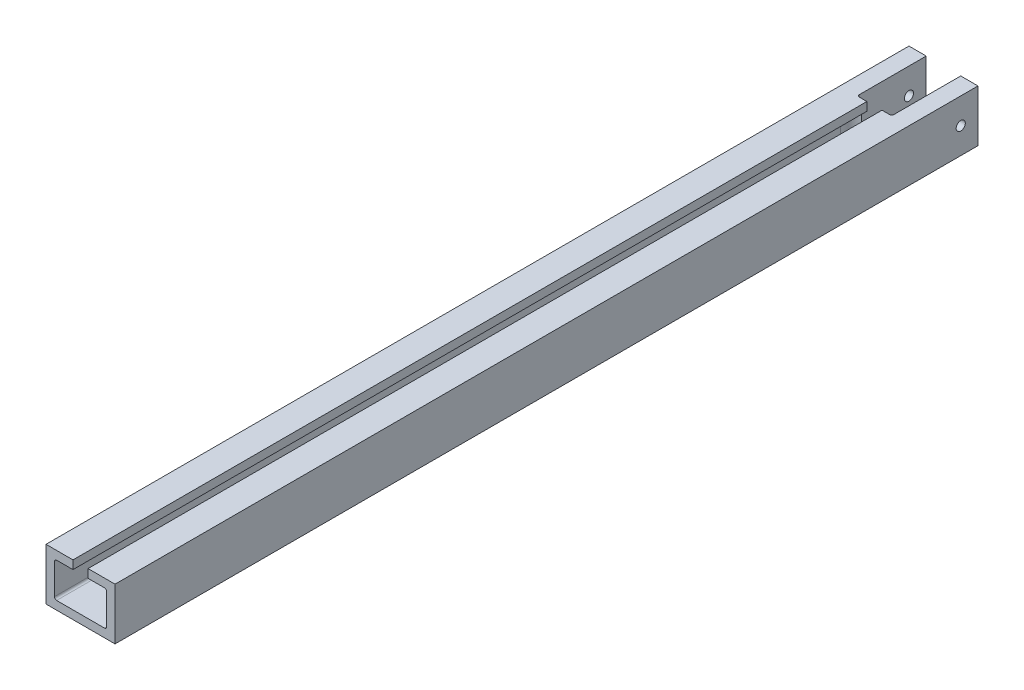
ISO-10303-21;
HEADER;
FILE_DESCRIPTION(('STEP AP214'),'2;1');
FILE_NAME('part.step','',(''),(''),'','','');
FILE_SCHEMA(('AUTOMOTIVE_DESIGN { 1 0 10303 214 1 1 1 1 }'));
ENDSEC;
DATA;
#1=APPLICATION_CONTEXT('core data for automotive mechanical design processes');
#2=APPLICATION_PROTOCOL_DEFINITION('international standard','automotive_design',2000,#1);
#3=PRODUCT_CONTEXT('',#1,'mechanical');
#4=PRODUCT('Part','Part','',(#3));
#5=PRODUCT_RELATED_PRODUCT_CATEGORY('part','',(#4));
#6=PRODUCT_DEFINITION_FORMATION('','',#4);
#7=PRODUCT_DEFINITION_CONTEXT('part definition',#1,'design');
#8=PRODUCT_DEFINITION('design','',#6,#7);
#9=PRODUCT_DEFINITION_SHAPE('','',#8);
#10=(LENGTH_UNIT() NAMED_UNIT(*) SI_UNIT(.MILLI.,.METRE.));
#11=(NAMED_UNIT(*) PLANE_ANGLE_UNIT() SI_UNIT($,.RADIAN.));
#12=(NAMED_UNIT(*) SI_UNIT($,.STERADIAN.) SOLID_ANGLE_UNIT());
#13=UNCERTAINTY_MEASURE_WITH_UNIT(LENGTH_MEASURE(1.E-05),#10,'distance_accuracy_value','');
#14=(GEOMETRIC_REPRESENTATION_CONTEXT(3) GLOBAL_UNCERTAINTY_ASSIGNED_CONTEXT((#13)) GLOBAL_UNIT_ASSIGNED_CONTEXT((#10,
#11,#12)) REPRESENTATION_CONTEXT('',''));
#15=CARTESIAN_POINT('',(0.,0.,0.));
#16=DIRECTION('',(0.,0.,1.));
#17=DIRECTION('',(1.,0.,0.));
#18=AXIS2_PLACEMENT_3D('',#15,#16,#17);
#19=CARTESIAN_POINT('',(0.,0.,76.2));
#20=DIRECTION('',(0.,0.,-1.));
#21=DIRECTION('',(-1.,0.,0.));
#22=AXIS2_PLACEMENT_3D('',#19,#20,#21);
#23=PLANE('',#22);
#24=DIRECTION('',(1.,0.,0.));
#25=VECTOR('',#24,1.);
#26=CARTESIAN_POINT('',(0.,25.654,76.2));
#27=LINE('',#26,#25);
#28=CARTESIAN_POINT('',(11.1125,25.654,76.2));
#29=VERTEX_POINT('',#28);
#30=CARTESIAN_POINT('',(22.225,25.654,76.2));
#31=VERTEX_POINT('',#30);
#32=EDGE_CURVE('E477',#29,#31,#27,.T.);
#33=ORIENTED_EDGE('',*,*,#32,.F.);
#34=DIRECTION('',(0.,-1.,0.));
#35=VECTOR('',#34,1.);
#36=CARTESIAN_POINT('',(11.1125,21.4188992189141,76.2));
#37=LINE('',#36,#35);
#38=CARTESIAN_POINT('',(11.1125,38.1,76.2));
#39=VERTEX_POINT('',#38);
#40=EDGE_CURVE('E496',#39,#29,#37,.T.);
#41=ORIENTED_EDGE('',*,*,#40,.F.);
#42=DIRECTION('',(1.,0.,0.));
#43=VECTOR('',#42,1.);
#44=CARTESIAN_POINT('',(25.4,38.1,76.2));
#45=LINE('',#44,#43);
#46=CARTESIAN_POINT('',(22.225,38.1,76.2));
#47=VERTEX_POINT('',#46);
#48=EDGE_CURVE('E512',#39,#47,#45,.T.);
#49=ORIENTED_EDGE('',*,*,#48,.T.);
#50=DIRECTION('',(0.,-1.,0.));
#51=VECTOR('',#50,1.);
#52=CARTESIAN_POINT('',(22.225,0.,76.2));
#53=LINE('',#52,#51);
#54=EDGE_CURVE('E574',#47,#31,#53,.T.);
#55=ORIENTED_EDGE('',*,*,#54,.T.);
#56=EDGE_LOOP('',(#33,#41,#49,#55));
#57=FACE_BOUND('',#56,.T.);
#58=ADVANCED_FACE('F45',(#57),#23,.T.);
#59=CARTESIAN_POINT('',(50.8,38.1,1244.6));
#60=DIRECTION('',(0.,-1.,0.));
#61=DIRECTION('',(0.,0.,-1.));
#62=AXIS2_PLACEMENT_3D('',#59,#60,#61);
#63=PLANE('',#62);
#64=ORIENTED_EDGE('',*,*,#48,.F.);
#65=DIRECTION('',(0.,0.,-1.));
#66=VECTOR('',#65,1.);
#67=CARTESIAN_POINT('',(11.1125,38.1,1244.6));
#68=LINE('',#67,#66);
#69=CARTESIAN_POINT('',(11.1125,38.1,1244.6));
#70=VERTEX_POINT('',#69);
#71=EDGE_CURVE('E503',#70,#39,#68,.T.);
#72=ORIENTED_EDGE('',*,*,#71,.F.);
#73=DIRECTION('',(-1.,0.,0.));
#74=VECTOR('',#73,1.);
#75=CARTESIAN_POINT('',(50.8,38.1,1244.6));
#76=LINE('',#75,#74);
#77=CARTESIAN_POINT('',(50.8,38.1,1244.6));
#78=VERTEX_POINT('',#77);
#79=EDGE_CURVE('E550',#78,#70,#76,.T.);
#80=ORIENTED_EDGE('',*,*,#79,.F.);
#81=DIRECTION('',(0.,0.,1.));
#82=VECTOR('',#81,1.);
#83=CARTESIAN_POINT('',(50.8,38.1,1244.6));
#84=LINE('',#83,#82);
#85=CARTESIAN_POINT('',(50.8,38.1,-25.4));
#86=VERTEX_POINT('',#85);
#87=EDGE_CURVE('E528',#86,#78,#84,.T.);
#88=ORIENTED_EDGE('',*,*,#87,.F.);
#89=DIRECTION('',(-1.,0.,0.));
#90=VECTOR('',#89,1.);
#91=CARTESIAN_POINT('',(50.8,38.1,-25.4));
#92=LINE('',#91,#90);
#93=CARTESIAN_POINT('',(25.4,38.1,-25.4));
#94=VERTEX_POINT('',#93);
#95=EDGE_CURVE('E554',#86,#94,#92,.T.);
#96=ORIENTED_EDGE('',*,*,#95,.T.);
#97=DIRECTION('',(0.,0.,-1.));
#98=VECTOR('',#97,1.);
#99=CARTESIAN_POINT('',(25.4,38.1,76.2));
#100=LINE('',#99,#98);
#101=CARTESIAN_POINT('',(25.4,38.1,73.025));
#102=VERTEX_POINT('',#101);
#103=EDGE_CURVE('E521',#102,#94,#100,.T.);
#104=ORIENTED_EDGE('',*,*,#103,.F.);
#105=CARTESIAN_POINT('',(22.225,38.1,73.025));
#106=DIRECTION('',(0.,-1.,0.));
#107=DIRECTION('',(0.,0.,-1.));
#108=AXIS2_PLACEMENT_3D('',#105,#106,#107);
#109=CIRCLE('',#108,3.175);
#110=EDGE_CURVE('E581',#102,#47,#109,.T.);
#111=ORIENTED_EDGE('',*,*,#110,.T.);
#112=EDGE_LOOP('',(#64,#72,#80,#88,#96,#104,#111));
#113=FACE_BOUND('',#112,.T.);
#114=ADVANCED_FACE('F404',(#113),#63,.F.);
#115=CARTESIAN_POINT('',(50.8,-38.1,-25.4));
#116=DIRECTION('',(0.,0.,1.));
#117=DIRECTION('',(1.,0.,0.));
#118=AXIS2_PLACEMENT_3D('',#115,#116,#117);
#119=PLANE('',#118);
#120=DIRECTION('',(-1.,0.,0.));
#121=VECTOR('',#120,1.);
#122=CARTESIAN_POINT('',(25.4,-28.575,-25.4));
#123=LINE('',#122,#121);
#124=CARTESIAN_POINT('',(22.225,-28.575,-25.4));
#125=VERTEX_POINT('',#124);
#126=CARTESIAN_POINT('',(-22.225,-28.575,-25.4));
#127=VERTEX_POINT('',#126);
#128=EDGE_CURVE('E515',#125,#127,#123,.T.);
#129=ORIENTED_EDGE('',*,*,#128,.F.);
#130=CARTESIAN_POINT('',(22.225,-25.4,-25.4));
#131=DIRECTION('',(0.,0.,1.));
#132=DIRECTION('',(1.,0.,0.));
#133=AXIS2_PLACEMENT_3D('',#130,#131,#132);
#134=CIRCLE('',#133,3.175);
#135=CARTESIAN_POINT('',(25.4,-25.4,-25.4));
#136=VERTEX_POINT('',#135);
#137=EDGE_CURVE('E579',#125,#136,#134,.T.);
#138=ORIENTED_EDGE('',*,*,#137,.T.);
#139=DIRECTION('',(0.,-1.,0.));
#140=VECTOR('',#139,1.);
#141=CARTESIAN_POINT('',(25.4,38.1,-25.4));
#142=LINE('',#141,#140);
#143=EDGE_CURVE('E505',#94,#136,#142,.T.);
#144=ORIENTED_EDGE('',*,*,#143,.F.);
#145=ORIENTED_EDGE('',*,*,#95,.F.);
#146=DIRECTION('',(0.,1.,0.));
#147=VECTOR('',#146,1.);
#148=CARTESIAN_POINT('',(50.8,-38.1,-25.4));
#149=LINE('',#148,#147);
#150=CARTESIAN_POINT('',(50.8,-38.1,-25.4));
#151=VERTEX_POINT('',#150);
#152=EDGE_CURVE('E525',#151,#86,#149,.T.);
#153=ORIENTED_EDGE('',*,*,#152,.F.);
#154=DIRECTION('',(-1.,0.,0.));
#155=VECTOR('',#154,1.);
#156=CARTESIAN_POINT('',(50.8,-38.1,-25.4));
#157=LINE('',#156,#155);
#158=CARTESIAN_POINT('',(-50.8,-38.1,-25.4));
#159=VERTEX_POINT('',#158);
#160=EDGE_CURVE('E535',#151,#159,#157,.T.);
#161=ORIENTED_EDGE('',*,*,#160,.T.);
#162=DIRECTION('',(0.,1.,0.));
#163=VECTOR('',#162,1.);
#164=CARTESIAN_POINT('',(-50.8,-38.1,-25.4));
#165=LINE('',#164,#163);
#166=CARTESIAN_POINT('',(-50.8,38.1,-25.4));
#167=VERTEX_POINT('',#166);
#168=EDGE_CURVE('E523',#159,#167,#165,.T.);
#169=ORIENTED_EDGE('',*,*,#168,.T.);
#170=CARTESIAN_POINT('',(-25.4,38.1,-25.4));
#171=VERTEX_POINT('',#170);
#172=EDGE_CURVE('E553',#171,#167,#92,.T.);
#173=ORIENTED_EDGE('',*,*,#172,.F.);
#174=DIRECTION('',(0.,1.,0.));
#175=VECTOR('',#174,1.);
#176=CARTESIAN_POINT('',(-25.4,38.1,-25.4));
#177=LINE('',#176,#175);
#178=CARTESIAN_POINT('',(-25.4,-25.4,-25.4));
#179=VERTEX_POINT('',#178);
#180=EDGE_CURVE('E518',#179,#171,#177,.T.);
#181=ORIENTED_EDGE('',*,*,#180,.F.);
#182=CARTESIAN_POINT('',(-22.225,-25.4,-25.4));
#183=DIRECTION('',(0.,0.,1.));
#184=DIRECTION('',(1.,0.,0.));
#185=AXIS2_PLACEMENT_3D('',#182,#183,#184);
#186=CIRCLE('',#185,3.175);
#187=EDGE_CURVE('E577',#179,#127,#186,.T.);
#188=ORIENTED_EDGE('',*,*,#187,.T.);
#189=EDGE_LOOP('',(#129,#138,#144,#145,#153,#161,#169,#173,#181,#188));
#190=FACE_BOUND('',#189,.T.);
#191=ADVANCED_FACE('F402',(#190),#119,.F.);
#192=CARTESIAN_POINT('',(-11.1125,38.1,1244.6));
#193=VERTEX_POINT('',#192);
#194=CARTESIAN_POINT('',(-50.8,38.1,1244.6));
#195=VERTEX_POINT('',#194);
#196=EDGE_CURVE('E549',#193,#195,#76,.T.);
#197=ORIENTED_EDGE('',*,*,#196,.F.);
#198=DIRECTION('',(0.,0.,-1.));
#199=VECTOR('',#198,1.);
#200=CARTESIAN_POINT('',(-11.1125,38.1,1244.6));
#201=LINE('',#200,#199);
#202=CARTESIAN_POINT('',(-11.1125,38.1,76.2));
#203=VERTEX_POINT('',#202);
#204=EDGE_CURVE('E499',#193,#203,#201,.T.);
#205=ORIENTED_EDGE('',*,*,#204,.T.);
#206=CARTESIAN_POINT('',(-22.225,38.1,76.2));
#207=VERTEX_POINT('',#206);
#208=EDGE_CURVE('E508',#207,#203,#45,.T.);
#209=ORIENTED_EDGE('',*,*,#208,.F.);
#210=CARTESIAN_POINT('',(-22.225,38.1,73.025));
#211=DIRECTION('',(0.,-1.,0.));
#212=DIRECTION('',(0.,0.,-1.));
#213=AXIS2_PLACEMENT_3D('',#210,#211,#212);
#214=CIRCLE('',#213,3.175);
#215=CARTESIAN_POINT('',(-25.4,38.1,73.025));
#216=VERTEX_POINT('',#215);
#217=EDGE_CURVE('E286',#207,#216,#214,.T.);
#218=ORIENTED_EDGE('',*,*,#217,.T.);
#219=DIRECTION('',(0.,0.,-1.));
#220=VECTOR('',#219,1.);
#221=CARTESIAN_POINT('',(-25.4,38.1,76.2));
#222=LINE('',#221,#220);
#223=EDGE_CURVE('E511',#216,#171,#222,.T.);
#224=ORIENTED_EDGE('',*,*,#223,.T.);
#225=ORIENTED_EDGE('',*,*,#172,.T.);
#226=DIRECTION('',(0.,0.,1.));
#227=VECTOR('',#226,1.);
#228=CARTESIAN_POINT('',(-50.8,38.1,1244.6));
#229=LINE('',#228,#227);
#230=EDGE_CURVE('E538',#167,#195,#229,.T.);
#231=ORIENTED_EDGE('',*,*,#230,.T.);
#232=EDGE_LOOP('',(#197,#205,#209,#218,#224,#225,#231));
#233=FACE_BOUND('',#232,.T.);
#234=ADVANCED_FACE('F398',(#233),#63,.F.);
#235=CARTESIAN_POINT('',(50.8,-38.1,1244.6));
#236=DIRECTION('',(0.,0.,-1.));
#237=DIRECTION('',(-1.,0.,0.));
#238=AXIS2_PLACEMENT_3D('',#235,#236,#237);
#239=PLANE('',#238);
#240=DIRECTION('',(0.,-1.,0.));
#241=VECTOR('',#240,1.);
#242=CARTESIAN_POINT('',(-38.354,-25.654,1244.6));
#243=LINE('',#242,#241);
#244=CARTESIAN_POINT('',(-38.354,22.479,1244.6));
#245=VERTEX_POINT('',#244);
#246=CARTESIAN_POINT('',(-38.354,-22.479,1244.6));
#247=VERTEX_POINT('',#246);
#248=EDGE_CURVE('E465',#245,#247,#243,.T.);
#249=ORIENTED_EDGE('',*,*,#248,.F.);
#250=CARTESIAN_POINT('',(-35.179,22.479,1244.6));
#251=DIRECTION('',(0.,0.,-1.));
#252=DIRECTION('',(-1.,0.,0.));
#253=AXIS2_PLACEMENT_3D('',#250,#251,#252);
#254=CIRCLE('',#253,3.175);
#255=CARTESIAN_POINT('',(-35.179,25.654,1244.6));
#256=VERTEX_POINT('',#255);
#257=EDGE_CURVE('E658',#245,#256,#254,.T.);
#258=ORIENTED_EDGE('',*,*,#257,.T.);
#259=DIRECTION('',(-1.,0.,0.));
#260=VECTOR('',#259,1.);
#261=CARTESIAN_POINT('',(-38.354,25.654,1244.6));
#262=LINE('',#261,#260);
#263=CARTESIAN_POINT('',(-11.1125,25.654,1244.6));
#264=VERTEX_POINT('',#263);
#265=EDGE_CURVE('E656',#264,#256,#262,.T.);
#266=ORIENTED_EDGE('',*,*,#265,.F.);
#267=DIRECTION('',(0.,1.,0.));
#268=VECTOR('',#267,1.);
#269=CARTESIAN_POINT('',(-11.1125,38.1,1244.6));
#270=LINE('',#269,#268);
#271=EDGE_CURVE('E493',#264,#193,#270,.T.);
#272=ORIENTED_EDGE('',*,*,#271,.T.);
#273=ORIENTED_EDGE('',*,*,#196,.T.);
#274=DIRECTION('',(0.,-1.,0.));
#275=VECTOR('',#274,1.);
#276=CARTESIAN_POINT('',(-50.8,-38.1,1244.6));
#277=LINE('',#276,#275);
#278=CARTESIAN_POINT('',(-50.8,-38.1,1244.6));
#279=VERTEX_POINT('',#278);
#280=EDGE_CURVE('E541',#195,#279,#277,.T.);
#281=ORIENTED_EDGE('',*,*,#280,.T.);
#282=DIRECTION('',(-1.,0.,0.));
#283=VECTOR('',#282,1.);
#284=CARTESIAN_POINT('',(50.8,-38.1,1244.6));
#285=LINE('',#284,#283);
#286=CARTESIAN_POINT('',(50.8,-38.1,1244.6));
#287=VERTEX_POINT('',#286);
#288=EDGE_CURVE('E546',#287,#279,#285,.T.);
#289=ORIENTED_EDGE('',*,*,#288,.F.);
#290=DIRECTION('',(0.,-1.,0.));
#291=VECTOR('',#290,1.);
#292=CARTESIAN_POINT('',(50.8,-38.1,1244.6));
#293=LINE('',#292,#291);
#294=EDGE_CURVE('E531',#78,#287,#293,.T.);
#295=ORIENTED_EDGE('',*,*,#294,.F.);
#296=ORIENTED_EDGE('',*,*,#79,.T.);
#297=DIRECTION('',(0.,-1.,0.));
#298=VECTOR('',#297,1.);
#299=CARTESIAN_POINT('',(11.1125,21.4188992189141,1244.6));
#300=LINE('',#299,#298);
#301=CARTESIAN_POINT('',(11.1125,25.654,1244.6));
#302=VERTEX_POINT('',#301);
#303=EDGE_CURVE('E495',#70,#302,#300,.T.);
#304=ORIENTED_EDGE('',*,*,#303,.T.);
#305=CARTESIAN_POINT('',(35.179,25.654,1244.6));
#306=VERTEX_POINT('',#305);
#307=EDGE_CURVE('E660',#306,#302,#262,.T.);
#308=ORIENTED_EDGE('',*,*,#307,.F.);
#309=CARTESIAN_POINT('',(35.179,22.479,1244.6));
#310=DIRECTION('',(0.,0.,-1.));
#311=DIRECTION('',(-1.,0.,0.));
#312=AXIS2_PLACEMENT_3D('',#309,#310,#311);
#313=CIRCLE('',#312,3.175);
#314=CARTESIAN_POINT('',(38.354,22.479,1244.6));
#315=VERTEX_POINT('',#314);
#316=EDGE_CURVE('E669',#306,#315,#313,.T.);
#317=ORIENTED_EDGE('',*,*,#316,.T.);
#318=DIRECTION('',(0.,1.,0.));
#319=VECTOR('',#318,1.);
#320=CARTESIAN_POINT('',(38.354,-25.654,1244.6));
#321=LINE('',#320,#319);
#322=CARTESIAN_POINT('',(38.354,-22.479,1244.6));
#323=VERTEX_POINT('',#322);
#324=EDGE_CURVE('E434',#323,#315,#321,.T.);
#325=ORIENTED_EDGE('',*,*,#324,.F.);
#326=CARTESIAN_POINT('',(35.179,-22.479,1244.6));
#327=DIRECTION('',(0.,0.,-1.));
#328=DIRECTION('',(-1.,0.,0.));
#329=AXIS2_PLACEMENT_3D('',#326,#327,#328);
#330=CIRCLE('',#329,3.175);
#331=CARTESIAN_POINT('',(35.179,-25.654,1244.6));
#332=VERTEX_POINT('',#331);
#333=EDGE_CURVE('E599',#323,#332,#330,.T.);
#334=ORIENTED_EDGE('',*,*,#333,.T.);
#335=DIRECTION('',(1.,0.,0.));
#336=VECTOR('',#335,1.);
#337=CARTESIAN_POINT('',(-38.354,-25.654,1244.6));
#338=LINE('',#337,#336);
#339=CARTESIAN_POINT('',(-35.179,-25.654,1244.6));
#340=VERTEX_POINT('',#339);
#341=EDGE_CURVE('E460',#340,#332,#338,.T.);
#342=ORIENTED_EDGE('',*,*,#341,.F.);
#343=CARTESIAN_POINT('',(-35.179,-22.479,1244.6));
#344=DIRECTION('',(0.,0.,-1.));
#345=DIRECTION('',(-1.,0.,0.));
#346=AXIS2_PLACEMENT_3D('',#343,#344,#345);
#347=CIRCLE('',#346,3.175);
#348=EDGE_CURVE('E597',#340,#247,#347,.T.);
#349=ORIENTED_EDGE('',*,*,#348,.T.);
#350=EDGE_LOOP('',(#249,#258,#266,#272,#273,#281,#289,#295,#296,#304,#308,#317,#325,#334,#342,#349));
#351=FACE_BOUND('',#350,.T.);
#352=ADVANCED_FACE('F394',(#351),#239,.F.);
#353=CARTESIAN_POINT('',(50.8,-38.1,1244.6));
#354=DIRECTION('',(0.,1.,0.));
#355=DIRECTION('',(0.,0.,1.));
#356=AXIS2_PLACEMENT_3D('',#353,#354,#355);
#357=PLANE('',#356);
#358=DIRECTION('',(0.,0.,-1.));
#359=VECTOR('',#358,1.);
#360=CARTESIAN_POINT('',(-50.8,-38.1,1244.6));
#361=LINE('',#360,#359);
#362=EDGE_CURVE('E529',#279,#159,#361,.T.);
#363=ORIENTED_EDGE('',*,*,#362,.T.);
#364=ORIENTED_EDGE('',*,*,#160,.F.);
#365=DIRECTION('',(0.,0.,-1.));
#366=VECTOR('',#365,1.);
#367=CARTESIAN_POINT('',(50.8,-38.1,1244.6));
#368=LINE('',#367,#366);
#369=EDGE_CURVE('E533',#287,#151,#368,.T.);
#370=ORIENTED_EDGE('',*,*,#369,.F.);
#371=ORIENTED_EDGE('',*,*,#288,.T.);
#372=EDGE_LOOP('',(#363,#364,#370,#371));
#373=FACE_BOUND('',#372,.T.);
#374=ADVANCED_FACE('F387',(#373),#357,.F.);
#375=CARTESIAN_POINT('',(50.8,0.,0.));
#376=DIRECTION('',(-1.,0.,0.));
#377=DIRECTION('',(0.,0.,1.));
#378=AXIS2_PLACEMENT_3D('',#375,#376,#377);
#379=PLANE('',#378);
#380=CARTESIAN_POINT('',(50.8,0.,0.));
#381=DIRECTION('',(1.,0.,0.));
#382=DIRECTION('',(0.,0.,-1.));
#383=AXIS2_PLACEMENT_3D('',#380,#381,#382);
#384=CIRCLE('',#383,6.731);
#385=CARTESIAN_POINT('',(50.8,0.,-6.731));
#386=VERTEX_POINT('',#385);
#387=EDGE_CURVE('E281',#386,#386,#384,.T.);
#388=ORIENTED_EDGE('',*,*,#387,.F.);
#389=EDGE_LOOP('',(#388));
#390=FACE_BOUND('',#389,.T.);
#391=ORIENTED_EDGE('',*,*,#152,.T.);
#392=ORIENTED_EDGE('',*,*,#87,.T.);
#393=ORIENTED_EDGE('',*,*,#294,.T.);
#394=ORIENTED_EDGE('',*,*,#369,.T.);
#395=EDGE_LOOP('',(#391,#392,#393,#394));
#396=FACE_BOUND('',#395,.T.);
#397=ADVANCED_FACE('F383',(#390,#396),#379,.F.);
#398=CARTESIAN_POINT('',(-50.8,0.,0.));
#399=DIRECTION('',(-1.,0.,0.));
#400=DIRECTION('',(0.,0.,1.));
#401=AXIS2_PLACEMENT_3D('',#398,#399,#400);
#402=PLANE('',#401);
#403=CARTESIAN_POINT('',(-50.8,0.,0.));
#404=DIRECTION('',(1.,0.,0.));
#405=DIRECTION('',(0.,0.,-1.));
#406=AXIS2_PLACEMENT_3D('',#403,#404,#405);
#407=CIRCLE('',#406,6.731);
#408=CARTESIAN_POINT('',(-50.8,0.,-6.731));
#409=VERTEX_POINT('',#408);
#410=EDGE_CURVE('E482',#409,#409,#407,.T.);
#411=ORIENTED_EDGE('',*,*,#410,.T.);
#412=EDGE_LOOP('',(#411));
#413=FACE_BOUND('',#412,.T.);
#414=ORIENTED_EDGE('',*,*,#168,.F.);
#415=ORIENTED_EDGE('',*,*,#362,.F.);
#416=ORIENTED_EDGE('',*,*,#280,.F.);
#417=ORIENTED_EDGE('',*,*,#230,.F.);
#418=EDGE_LOOP('',(#414,#415,#416,#417));
#419=FACE_BOUND('',#418,.T.);
#420=ADVANCED_FACE('F379',(#413,#419),#402,.T.);
#421=CARTESIAN_POINT('',(25.4,38.1,76.2));
#422=DIRECTION('',(1.,0.,0.));
#423=DIRECTION('',(0.,1.,0.));
#424=AXIS2_PLACEMENT_3D('',#421,#422,#423);
#425=PLANE('',#424);
#426=CARTESIAN_POINT('',(25.4,0.,0.));
#427=DIRECTION('',(1.,0.,0.));
#428=DIRECTION('',(0.,1.,0.));
#429=AXIS2_PLACEMENT_3D('',#426,#427,#428);
#430=CIRCLE('',#429,6.731);
#431=CARTESIAN_POINT('',(25.4,6.731,0.));
#432=VERTEX_POINT('',#431);
#433=EDGE_CURVE('E489',#432,#432,#430,.T.);
#434=ORIENTED_EDGE('',*,*,#433,.T.);
#435=EDGE_LOOP('',(#434));
#436=FACE_BOUND('',#435,.T.);
#437=DIRECTION('',(0.,0.,-1.));
#438=VECTOR('',#437,1.);
#439=CARTESIAN_POINT('',(25.4,-25.4,76.2));
#440=LINE('',#439,#438);
#441=CARTESIAN_POINT('',(25.4,-25.4,71.9010977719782));
#442=VERTEX_POINT('',#441);
#443=EDGE_CURVE('E570',#136,#442,#440,.F.);
#444=ORIENTED_EDGE('',*,*,#443,.T.);
#445=CARTESIAN_POINT('',(25.4,-25.4,71.9010977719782));
#446=CARTESIAN_POINT('',(25.4,-25.3653410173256,71.8140104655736));
#447=CARTESIAN_POINT('',(25.4,-25.3271658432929,71.7283154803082));
#448=CARTESIAN_POINT('',(25.4,-25.2439496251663,71.5602994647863));
#449=CARTESIAN_POINT('',(25.4,-25.1989067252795,71.4779793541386));
#450=CARTESIAN_POINT('',(25.4,-25.1020565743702,71.3172108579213));
#451=CARTESIAN_POINT('',(25.4,-25.0502377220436,71.2387694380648));
#452=CARTESIAN_POINT('',(25.4,-24.9401869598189,71.0865625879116));
#453=CARTESIAN_POINT('',(25.4,-24.8819556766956,71.0127967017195));
#454=CARTESIAN_POINT('',(25.4,-24.6978392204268,70.7991458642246));
#455=CARTESIAN_POINT('',(25.4,-24.5626388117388,70.6670867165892));
#456=CARTESIAN_POINT('',(25.4,-24.2710903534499,70.4290043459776));
#457=CARTESIAN_POINT('',(25.4,-24.114761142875,70.3229581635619));
#458=CARTESIAN_POINT('',(25.4,-23.8717026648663,70.1884758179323));
#459=CARTESIAN_POINT('',(25.4,-23.7912276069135,70.1484189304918));
#460=CARTESIAN_POINT('',(25.4,-23.6270923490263,70.0755030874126));
#461=CARTESIAN_POINT('',(25.4,-23.5434335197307,70.0426410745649));
#462=CARTESIAN_POINT('',(25.4,-23.3736045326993,69.9844489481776));
#463=CARTESIAN_POINT('',(25.4,-23.2874360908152,69.9591138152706));
#464=CARTESIAN_POINT('',(25.4,-23.1132238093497,69.916196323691));
#465=CARTESIAN_POINT('',(25.4,-23.0251808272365,69.898610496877));
#466=CARTESIAN_POINT('',(25.4,-22.8607970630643,69.8733386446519));
#467=CARTESIAN_POINT('',(25.4,-22.7846186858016,69.8645840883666));
#468=CARTESIAN_POINT('',(25.4,-22.6319618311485,69.8529169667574));
#469=CARTESIAN_POINT('',(25.4,-22.5554841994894,69.8499933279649));
#470=CARTESIAN_POINT('',(25.4,-22.479,69.8500000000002));
#471=B_SPLINE_CURVE_WITH_KNOTS('',3,(#445,#446,#447,#448,#449,#450,#451,#452,#453,#454,#455,
#456,#457,#458,#459,#460,#461,#462,#463,#464,#465,#466,#467,#468,#469,#470),.UNSPECIFIED.,.F.,
.F.,(4,2,2,2,2,2,2,2,2,2,2,2,4),(0.,0.281124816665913,0.562325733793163,0.844014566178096,
1.12567588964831,1.68961652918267,2.25305762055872,2.52245367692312,2.79173503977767,
3.0608364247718,3.32981725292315,3.55963852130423,3.78902291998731),.UNSPECIFIED.);
#472=CARTESIAN_POINT('',(25.4,-22.479,69.8500000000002));
#473=VERTEX_POINT('',#472);
#474=EDGE_CURVE('E360',#442,#473,#471,.T.);
#475=ORIENTED_EDGE('',*,*,#474,.T.);
#476=DIRECTION('',(0.,1.,0.));
#477=VECTOR('',#476,1.);
#478=CARTESIAN_POINT('',(25.4,38.1,69.8500000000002));
#479=LINE('',#478,#477);
#480=CARTESIAN_POINT('',(25.4,22.479,69.8500000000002));
#481=VERTEX_POINT('',#480);
#482=EDGE_CURVE('E257',#473,#481,#479,.T.);
#483=ORIENTED_EDGE('',*,*,#482,.T.);
#484=CARTESIAN_POINT('',(25.4,22.479,69.8500000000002));
#485=CARTESIAN_POINT('',(25.4,22.5647313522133,69.8499890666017));
#486=CARTESIAN_POINT('',(25.4,22.6504574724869,69.853664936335));
#487=CARTESIAN_POINT('',(25.4,22.8212734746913,69.8683061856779));
#488=CARTESIAN_POINT('',(25.4,22.9063634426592,69.8792705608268));
#489=CARTESIAN_POINT('',(25.4,23.0751350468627,69.9083754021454));
#490=CARTESIAN_POINT('',(25.4,23.1588191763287,69.9265013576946));
#491=CARTESIAN_POINT('',(25.4,23.3243363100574,69.9697478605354));
#492=CARTESIAN_POINT('',(25.4,23.4061693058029,69.9948684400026));
#493=CARTESIAN_POINT('',(25.4,23.6480387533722,70.0804279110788));
#494=CARTESIAN_POINT('',(25.4,23.8045905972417,70.1510898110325));
#495=CARTESIAN_POINT('',(25.4,24.1038365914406,70.317173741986));
#496=CARTESIAN_POINT('',(25.4,24.2465285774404,70.4125996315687));
#497=CARTESIAN_POINT('',(25.4,24.5173191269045,70.6272350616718));
#498=CARTESIAN_POINT('',(25.4,24.6450786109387,70.7468723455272));
#499=CARTESIAN_POINT('',(25.4,24.8798577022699,71.004998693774));
#500=CARTESIAN_POINT('',(25.4,24.9868715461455,71.1434929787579));
#501=CARTESIAN_POINT('',(25.4,25.1829173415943,71.4426789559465));
#502=CARTESIAN_POINT('',(25.4,25.2707808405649,71.6041348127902));
#503=CARTESIAN_POINT('',(25.4,25.419945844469,71.9388800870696));
#504=CARTESIAN_POINT('',(25.4,25.4812462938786,72.1121699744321));
#505=CARTESIAN_POINT('',(25.4,25.5613504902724,72.4093687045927));
#506=CARTESIAN_POINT('',(25.4,25.5874742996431,72.5313665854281));
#507=CARTESIAN_POINT('',(25.4,25.6270559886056,72.7771169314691));
#508=CARTESIAN_POINT('',(25.4,25.6405427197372,72.9008647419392));
#509=CARTESIAN_POINT('',(25.4,25.6477517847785,73.025));
#510=B_SPLINE_CURVE_WITH_KNOTS('',3,(#484,#485,#486,#487,#488,#489,#490,#491,#492,#493,#494,
#495,#496,#497,#498,#499,#500,#501,#502,#503,#504,#505,#506,#507,#508,#509),.UNSPECIFIED.,.F.,
.F.,(4,2,2,2,2,2,2,2,2,2,2,2,4),(0.,0.257106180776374,0.514176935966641,0.770729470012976,
1.02728318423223,1.53995482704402,2.05270639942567,2.57546296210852,3.09836454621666,
3.64744444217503,4.1965461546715,4.57022123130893,4.94304108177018),.UNSPECIFIED.);
#511=CARTESIAN_POINT('',(25.4,25.6477517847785,73.025));
#512=VERTEX_POINT('',#511);
#513=EDGE_CURVE('E367',#481,#512,#510,.T.);
#514=ORIENTED_EDGE('',*,*,#513,.T.);
#515=DIRECTION('',(0.,-1.,0.));
#516=VECTOR('',#515,1.);
#517=CARTESIAN_POINT('',(25.4,38.1,73.025));
#518=LINE('',#517,#516);
#519=EDGE_CURVE('E568',#512,#102,#518,.F.);
#520=ORIENTED_EDGE('',*,*,#519,.T.);
#521=ORIENTED_EDGE('',*,*,#103,.T.);
#522=ORIENTED_EDGE('',*,*,#143,.T.);
#523=EDGE_LOOP('',(#444,#475,#483,#514,#520,#521,#522));
#524=FACE_BOUND('',#523,.T.);
#525=ADVANCED_FACE('F373',(#436,#524),#425,.F.);
#526=CARTESIAN_POINT('',(-25.4,38.1,76.2));
#527=DIRECTION('',(-1.,0.,0.));
#528=DIRECTION('',(0.,-1.,0.));
#529=AXIS2_PLACEMENT_3D('',#526,#527,#528);
#530=PLANE('',#529);
#531=CARTESIAN_POINT('',(-25.4,0.,0.));
#532=DIRECTION('',(-1.,0.,0.));
#533=DIRECTION('',(0.,-1.,0.));
#534=AXIS2_PLACEMENT_3D('',#531,#532,#533);
#535=CIRCLE('',#534,6.731);
#536=CARTESIAN_POINT('',(-25.4,-6.731,0.));
#537=VERTEX_POINT('',#536);
#538=EDGE_CURVE('E485',#537,#537,#535,.T.);
#539=ORIENTED_EDGE('',*,*,#538,.T.);
#540=EDGE_LOOP('',(#539));
#541=FACE_BOUND('',#540,.T.);
#542=DIRECTION('',(0.,1.,0.));
#543=VECTOR('',#542,1.);
#544=CARTESIAN_POINT('',(-25.4,38.1,73.025));
#545=LINE('',#544,#543);
#546=CARTESIAN_POINT('',(-25.4,25.6477517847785,73.025));
#547=VERTEX_POINT('',#546);
#548=EDGE_CURVE('E557',#216,#547,#545,.F.);
#549=ORIENTED_EDGE('',*,*,#548,.T.);
#550=CARTESIAN_POINT('',(-25.4,25.6477517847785,73.025));
#551=CARTESIAN_POINT('',(-25.4,25.641961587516,72.9253009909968));
#552=CARTESIAN_POINT('',(-25.4,25.6321199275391,72.8258326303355));
#553=CARTESIAN_POINT('',(-25.4,25.6043265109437,72.6280114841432));
#554=CARTESIAN_POINT('',(-25.4,25.5863727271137,72.5296589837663));
#555=CARTESIAN_POINT('',(-25.4,25.5423031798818,72.3345636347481));
#556=CARTESIAN_POINT('',(-25.4,25.5161698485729,72.2378247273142));
#557=CARTESIAN_POINT('',(-25.4,25.4558382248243,72.0469330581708));
#558=CARTESIAN_POINT('',(-25.4,25.421640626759,71.9527800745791));
#559=CARTESIAN_POINT('',(-25.4,25.3069165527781,71.6748903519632));
#560=CARTESIAN_POINT('',(-25.4,25.2143088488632,71.4959464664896));
#561=CARTESIAN_POINT('',(-25.4,24.9989184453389,71.1575878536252));
#562=CARTESIAN_POINT('',(-25.4,24.8761733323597,70.9981491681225));
#563=CARTESIAN_POINT('',(-25.4,24.6105078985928,70.712012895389));
#564=CARTESIAN_POINT('',(-25.4,24.4689521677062,70.5840520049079));
#565=CARTESIAN_POINT('',(-25.4,24.1651209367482,70.3555185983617));
#566=CARTESIAN_POINT('',(-25.4,24.002840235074,70.2549529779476));
#567=CARTESIAN_POINT('',(-25.4,23.6727791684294,70.090461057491));
#568=CARTESIAN_POINT('',(-25.4,23.5059279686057,70.0246837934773));
#569=CARTESIAN_POINT('',(-25.4,23.2492729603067,69.9487863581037));
#570=CARTESIAN_POINT('',(-25.4,23.162689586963,69.9272854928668));
#571=CARTESIAN_POINT('',(-25.4,22.9879749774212,69.8920163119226));
#572=CARTESIAN_POINT('',(-25.4,22.8998445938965,69.8782438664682));
#573=CARTESIAN_POINT('',(-25.4,22.7560926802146,69.8622723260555));
#574=CARTESIAN_POINT('',(-25.4,22.7007252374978,69.857668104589));
#575=CARTESIAN_POINT('',(-25.4,22.5899078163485,69.8515340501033));
#576=CARTESIAN_POINT('',(-25.4,22.5344581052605,69.8499993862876));
#577=CARTESIAN_POINT('',(-25.4,22.479,69.8500000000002));
#578=B_SPLINE_CURVE_WITH_KNOTS('',3,(#550,#551,#552,#553,#554,#555,#556,#557,#558,#559,#560,
#561,#562,#563,#564,#565,#566,#567,#568,#569,#570,#571,#572,#573,#574,#575,#576,#577),
.UNSPECIFIED.,.F.,.F.,(4,2,2,2,2,2,2,2,2,2,2,2,2,4),(0.,0.299524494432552,0.599123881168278,
0.899371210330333,1.19959269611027,1.80071426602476,2.40108990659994,2.97054590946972,
3.54014511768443,4.07522814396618,4.34258309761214,4.60979505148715,4.77639388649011,
4.94273032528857),.UNSPECIFIED.);
#579=CARTESIAN_POINT('',(-25.4,22.479,69.8500000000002));
#580=VERTEX_POINT('',#579);
#581=EDGE_CURVE('E459',#547,#580,#578,.T.);
#582=ORIENTED_EDGE('',*,*,#581,.T.);
#583=DIRECTION('',(0.,-1.,0.));
#584=VECTOR('',#583,1.);
#585=CARTESIAN_POINT('',(-25.4,38.1,69.8500000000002));
#586=LINE('',#585,#584);
#587=CARTESIAN_POINT('',(-25.4,-22.479,69.8500000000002));
#588=VERTEX_POINT('',#587);
#589=EDGE_CURVE('E456',#580,#588,#586,.T.);
#590=ORIENTED_EDGE('',*,*,#589,.T.);
#591=CARTESIAN_POINT('',(-25.4,-22.479,69.8500000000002));
#592=CARTESIAN_POINT('',(-25.4,-22.5647250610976,69.8499890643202));
#593=CARTESIAN_POINT('',(-25.4,-22.6504448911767,69.8536643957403));
#594=CARTESIAN_POINT('',(-25.4,-22.8212485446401,69.8683035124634));
#595=CARTESIAN_POINT('',(-25.4,-22.9063324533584,69.8792663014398));
#596=CARTESIAN_POINT('',(-25.4,-23.0751044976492,69.9083690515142));
#597=CARTESIAN_POINT('',(-25.4,-23.1587949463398,69.9264955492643));
#598=CARTESIAN_POINT('',(-25.4,-23.3243244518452,69.9697442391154));
#599=CARTESIAN_POINT('',(-25.4,-23.4061635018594,69.994866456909));
#600=CARTESIAN_POINT('',(-25.4,-23.6480428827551,70.0804292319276));
#601=CARTESIAN_POINT('',(-25.4,-23.8045982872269,70.1510925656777));
#602=CARTESIAN_POINT('',(-25.4,-24.1038445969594,70.3171797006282));
#603=CARTESIAN_POINT('',(-25.4,-24.2465340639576,70.4126060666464));
#604=CARTESIAN_POINT('',(-25.4,-24.5173261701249,70.6272385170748));
#605=CARTESIAN_POINT('',(-25.4,-24.6450879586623,70.7468741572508));
#606=CARTESIAN_POINT('',(-25.4,-24.8798795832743,71.0050312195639));
#607=CARTESIAN_POINT('',(-25.4,-24.9869064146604,71.1435553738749));
#608=CARTESIAN_POINT('',(-25.4,-25.1456591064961,71.3858130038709));
#609=CARTESIAN_POINT('',(-25.4,-25.2038270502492,71.485403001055));
#610=CARTESIAN_POINT('',(-25.4,-25.3097370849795,71.6896633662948));
#611=CARTESIAN_POINT('',(-25.4,-25.3575052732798,71.7943201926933));
#612=CARTESIAN_POINT('',(-25.4,-25.4,71.9010977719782));
#613=B_SPLINE_CURVE_WITH_KNOTS('',3,(#591,#592,#593,#594,#595,#596,#597,#598,#599,#600,#601,
#602,#603,#604,#605,#606,#607,#608,#609,#610,#611,#612),.UNSPECIFIED.,.F.,.F.,(4,2,2,2,2,2,2,2,
2,2,4),(0.,0.257087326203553,0.514139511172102,0.770710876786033,1.02728318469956,
1.53996823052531,2.05270639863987,2.57549761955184,3.09836454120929,3.44381889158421,
3.7883960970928),.UNSPECIFIED.);
#614=CARTESIAN_POINT('',(-25.4,-25.4,71.9010977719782));
#615=VERTEX_POINT('',#614);
#616=EDGE_CURVE('E420',#588,#615,#613,.T.);
#617=ORIENTED_EDGE('',*,*,#616,.T.);
#618=DIRECTION('',(0.,0.,-1.));
#619=VECTOR('',#618,1.);
#620=CARTESIAN_POINT('',(-25.4,-25.4,-25.4));
#621=LINE('',#620,#619);
#622=EDGE_CURVE('E63',#615,#179,#621,.T.);
#623=ORIENTED_EDGE('',*,*,#622,.T.);
#624=ORIENTED_EDGE('',*,*,#180,.T.);
#625=ORIENTED_EDGE('',*,*,#223,.F.);
#626=EDGE_LOOP('',(#549,#582,#590,#617,#623,#624,#625));
#627=FACE_BOUND('',#626,.T.);
#628=ADVANCED_FACE('F378',(#541,#627),#530,.F.);
#629=CARTESIAN_POINT('',(25.4,-28.575,76.2));
#630=DIRECTION('',(0.,-1.,0.));
#631=DIRECTION('',(0.,0.,-1.));
#632=AXIS2_PLACEMENT_3D('',#629,#630,#631);
#633=PLANE('',#632);
#634=ORIENTED_EDGE('',*,*,#128,.T.);
#635=DIRECTION('',(0.,0.,-1.));
#636=VECTOR('',#635,1.);
#637=CARTESIAN_POINT('',(-22.225,-28.575,76.2));
#638=LINE('',#637,#636);
#639=CARTESIAN_POINT('',(-22.225,-28.575,73.025));
#640=VERTEX_POINT('',#639);
#641=EDGE_CURVE('E565',#127,#640,#638,.F.);
#642=ORIENTED_EDGE('',*,*,#641,.T.);
#643=DIRECTION('',(-1.,0.,0.));
#644=VECTOR('',#643,1.);
#645=CARTESIAN_POINT('',(25.4,-28.575,73.025));
#646=LINE('',#645,#644);
#647=CARTESIAN_POINT('',(22.225,-28.575,73.025));
#648=VERTEX_POINT('',#647);
#649=EDGE_CURVE('E271',#640,#648,#646,.F.);
#650=ORIENTED_EDGE('',*,*,#649,.T.);
#651=DIRECTION('',(0.,0.,-1.));
#652=VECTOR('',#651,1.);
#653=CARTESIAN_POINT('',(22.225,-28.575,-25.4));
#654=LINE('',#653,#652);
#655=EDGE_CURVE('E563',#648,#125,#654,.T.);
#656=ORIENTED_EDGE('',*,*,#655,.T.);
#657=EDGE_LOOP('',(#634,#642,#650,#656));
#658=FACE_BOUND('',#657,.T.);
#659=ADVANCED_FACE('F381',(#658),#633,.F.);
#660=DIRECTION('',(1.,0.,0.));
#661=VECTOR('',#660,1.);
#662=CARTESIAN_POINT('',(0.,25.654,76.2));
#663=LINE('',#662,#661);
#664=CARTESIAN_POINT('',(-22.225,25.654,76.2));
#665=VERTEX_POINT('',#664);
#666=CARTESIAN_POINT('',(-11.1125,25.654,76.2));
#667=VERTEX_POINT('',#666);
#668=EDGE_CURVE('E470',#665,#667,#663,.T.);
#669=ORIENTED_EDGE('',*,*,#668,.F.);
#670=DIRECTION('',(0.,1.,0.));
#671=VECTOR('',#670,1.);
#672=CARTESIAN_POINT('',(-22.225,0.,76.2));
#673=LINE('',#672,#671);
#674=EDGE_CURVE('E572',#665,#207,#673,.T.);
#675=ORIENTED_EDGE('',*,*,#674,.T.);
#676=ORIENTED_EDGE('',*,*,#208,.T.);
#677=DIRECTION('',(0.,1.,0.));
#678=VECTOR('',#677,1.);
#679=CARTESIAN_POINT('',(-11.1125,38.1,76.2));
#680=LINE('',#679,#678);
#681=EDGE_CURVE('E492',#667,#203,#680,.T.);
#682=ORIENTED_EDGE('',*,*,#681,.F.);
#683=EDGE_LOOP('',(#669,#675,#676,#682));
#684=FACE_BOUND('',#683,.T.);
#685=ADVANCED_FACE('F628',(#684),#23,.T.);
#686=CARTESIAN_POINT('',(11.1125,21.4188992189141,1244.6));
#687=DIRECTION('',(1.,0.,0.));
#688=DIRECTION('',(0.,0.,-1.));
#689=AXIS2_PLACEMENT_3D('',#686,#687,#688);
#690=PLANE('',#689);
#691=ORIENTED_EDGE('',*,*,#40,.T.);
#692=DIRECTION('',(0.,0.,1.));
#693=VECTOR('',#692,1.);
#694=CARTESIAN_POINT('',(11.1125,25.654,1244.6));
#695=LINE('',#694,#693);
#696=EDGE_CURVE('E276',#29,#302,#695,.T.);
#697=ORIENTED_EDGE('',*,*,#696,.T.);
#698=ORIENTED_EDGE('',*,*,#303,.F.);
#699=ORIENTED_EDGE('',*,*,#71,.T.);
#700=EDGE_LOOP('',(#691,#697,#698,#699));
#701=FACE_BOUND('',#700,.T.);
#702=ADVANCED_FACE('F636',(#701),#690,.F.);
#703=CARTESIAN_POINT('',(-11.1125,38.1,1244.6));
#704=DIRECTION('',(-1.,0.,0.));
#705=DIRECTION('',(0.,0.,1.));
#706=AXIS2_PLACEMENT_3D('',#703,#704,#705);
#707=PLANE('',#706);
#708=ORIENTED_EDGE('',*,*,#271,.F.);
#709=DIRECTION('',(0.,0.,-1.));
#710=VECTOR('',#709,1.);
#711=CARTESIAN_POINT('',(-11.1125,25.654,1244.6));
#712=LINE('',#711,#710);
#713=EDGE_CURVE('E472',#264,#667,#712,.T.);
#714=ORIENTED_EDGE('',*,*,#713,.T.);
#715=ORIENTED_EDGE('',*,*,#681,.T.);
#716=ORIENTED_EDGE('',*,*,#204,.F.);
#717=EDGE_LOOP('',(#708,#714,#715,#716));
#718=FACE_BOUND('',#717,.T.);
#719=ADVANCED_FACE('F642',(#718),#707,.F.);
#720=CARTESIAN_POINT('',(-50.8,0.,0.));
#721=DIRECTION('',(1.,0.,0.));
#722=DIRECTION('',(0.,0.,-1.));
#723=AXIS2_PLACEMENT_3D('',#720,#721,#722);
#724=CYLINDRICAL_SURFACE('',#723,6.731);
#725=ORIENTED_EDGE('',*,*,#410,.F.);
#726=EDGE_LOOP('',(#725));
#727=FACE_BOUND('',#726,.T.);
#728=ORIENTED_EDGE('',*,*,#538,.F.);
#729=EDGE_LOOP('',(#728));
#730=FACE_BOUND('',#729,.T.);
#731=ADVANCED_FACE('F839',(#727,#730),#724,.F.);
#732=ORIENTED_EDGE('',*,*,#387,.T.);
#733=EDGE_LOOP('',(#732));
#734=FACE_BOUND('',#733,.T.);
#735=ORIENTED_EDGE('',*,*,#433,.F.);
#736=EDGE_LOOP('',(#735));
#737=FACE_BOUND('',#736,.T.);
#738=ADVANCED_FACE('F832',(#734,#737),#724,.F.);
#739=CARTESIAN_POINT('',(22.225,0.,73.025));
#740=DIRECTION('',(0.,-1.,0.));
#741=DIRECTION('',(1.,0.,0.));
#742=AXIS2_PLACEMENT_3D('',#739,#740,#741);
#743=CYLINDRICAL_SURFACE('',#742,3.175);
#744=ORIENTED_EDGE('',*,*,#519,.F.);
#745=CARTESIAN_POINT('',(25.4,25.6477517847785,73.025));
#746=CARTESIAN_POINT('',(25.4000006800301,25.6498222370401,73.0604152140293));
#747=CARTESIAN_POINT('',(25.3994081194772,25.6513781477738,73.0958256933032));
#748=CARTESIAN_POINT('',(25.3970365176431,25.6534608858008,73.1666371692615));
#749=CARTESIAN_POINT('',(25.3952574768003,25.6539877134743,73.2020381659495));
#750=CARTESIAN_POINT('',(25.3928851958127,25.654,73.2374344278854));
#751=B_SPLINE_CURVE_WITH_KNOTS('',3,(#745,#746,#747,#748,#749,#750),.UNSPECIFIED.,.F.,.F.,(4,2,
4),(0.,0.106348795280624,0.212697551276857),.UNSPECIFIED.);
#752=CARTESIAN_POINT('',(25.3928851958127,25.654,73.2374344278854));
#753=VERTEX_POINT('',#752);
#754=EDGE_CURVE('E594',#512,#753,#751,.T.);
#755=ORIENTED_EDGE('',*,*,#754,.T.);
#756=CARTESIAN_POINT('',(22.225,25.654,73.025));
#757=DIRECTION('',(0.,1.,0.));
#758=DIRECTION('',(0.,0.,1.));
#759=AXIS2_PLACEMENT_3D('',#756,#757,#758);
#760=CIRCLE('',#759,3.175);
#761=EDGE_CURVE('E475',#753,#31,#760,.F.);
#762=ORIENTED_EDGE('',*,*,#761,.T.);
#763=ORIENTED_EDGE('',*,*,#54,.F.);
#764=ORIENTED_EDGE('',*,*,#110,.F.);
#765=EDGE_LOOP('',(#744,#755,#762,#763,#764));
#766=FACE_BOUND('',#765,.T.);
#767=ADVANCED_FACE('F699',(#766),#743,.F.);
#768=CARTESIAN_POINT('',(22.225,-25.4,76.2));
#769=DIRECTION('',(0.,0.,1.));
#770=DIRECTION('',(1.,0.,0.));
#771=AXIS2_PLACEMENT_3D('',#768,#769,#770);
#772=CYLINDRICAL_SURFACE('',#771,3.175);
#773=CARTESIAN_POINT('',(22.225,-25.4,73.025));
#774=DIRECTION('',(0.,0.,-1.));
#775=DIRECTION('',(-1.,0.,0.));
#776=AXIS2_PLACEMENT_3D('',#773,#774,#775);
#777=CIRCLE('',#776,3.175);
#778=CARTESIAN_POINT('',(25.3903010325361,-25.6479805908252,73.025));
#779=VERTEX_POINT('',#778);
#780=EDGE_CURVE('E274',#779,#648,#777,.T.);
#781=ORIENTED_EDGE('',*,*,#780,.F.);
#782=CARTESIAN_POINT('',(25.3903010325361,-25.6479805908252,73.025));
#783=CARTESIAN_POINT('',(25.3907040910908,-25.6424772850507,72.9285220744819));
#784=CARTESIAN_POINT('',(25.3914487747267,-25.6331444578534,72.8322579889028));
#785=CARTESIAN_POINT('',(25.3932855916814,-25.6069009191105,72.64140625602));
#786=CARTESIAN_POINT('',(25.3943754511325,-25.5900395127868,72.5468117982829));
#787=CARTESIAN_POINT('',(25.3965805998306,-25.5487470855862,72.3592790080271));
#788=CARTESIAN_POINT('',(25.3976958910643,-25.5243154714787,72.2663408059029));
#789=CARTESIAN_POINT('',(25.399395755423,-25.4678490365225,72.0821380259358));
#790=CARTESIAN_POINT('',(25.3999768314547,-25.4357658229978,71.9908882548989));
#791=CARTESIAN_POINT('',(25.4000000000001,-25.4,71.9010977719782));
#792=B_SPLINE_CURVE_WITH_KNOTS('',3,(#782,#783,#784,#785,#786,#787,#788,#789,#790,#791),
.UNSPECIFIED.,.F.,.F.,(4,2,2,2,4),(0.,0.289839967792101,0.577808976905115,0.865800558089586,
1.15566424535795),.UNSPECIFIED.);
#793=EDGE_CURVE('E336',#779,#442,#792,.T.);
#794=ORIENTED_EDGE('',*,*,#793,.T.);
#795=ORIENTED_EDGE('',*,*,#443,.F.);
#796=ORIENTED_EDGE('',*,*,#137,.F.);
#797=ORIENTED_EDGE('',*,*,#655,.F.);
#798=EDGE_LOOP('',(#781,#794,#795,#796,#797));
#799=FACE_BOUND('',#798,.T.);
#800=ADVANCED_FACE('F686',(#799),#772,.F.);
#801=CARTESIAN_POINT('',(-22.225,0.,73.025));
#802=DIRECTION('',(0.,1.,0.));
#803=DIRECTION('',(-1.,0.,0.));
#804=AXIS2_PLACEMENT_3D('',#801,#802,#803);
#805=CYLINDRICAL_SURFACE('',#804,3.175);
#806=ORIENTED_EDGE('',*,*,#674,.F.);
#807=CARTESIAN_POINT('',(-22.225,25.654,73.025));
#808=DIRECTION('',(0.,1.,0.));
#809=DIRECTION('',(0.,0.,1.));
#810=AXIS2_PLACEMENT_3D('',#807,#808,#809);
#811=CIRCLE('',#810,3.175);
#812=CARTESIAN_POINT('',(-25.3928851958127,25.654,73.2374344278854));
#813=VERTEX_POINT('',#812);
#814=EDGE_CURVE('E282',#665,#813,#811,.F.);
#815=ORIENTED_EDGE('',*,*,#814,.T.);
#816=CARTESIAN_POINT('',(-25.3928851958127,25.654,73.2374344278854));
#817=CARTESIAN_POINT('',(-25.3952574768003,25.6539877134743,73.2020381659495));
#818=CARTESIAN_POINT('',(-25.3970365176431,25.6534608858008,73.1666371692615));
#819=CARTESIAN_POINT('',(-25.3994081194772,25.6513781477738,73.0958256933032));
#820=CARTESIAN_POINT('',(-25.4000006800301,25.6498222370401,73.0604152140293));
#821=CARTESIAN_POINT('',(-25.4,25.6477517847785,73.025));
#822=B_SPLINE_CURVE_WITH_KNOTS('',3,(#816,#817,#818,#819,#820,#821),.UNSPECIFIED.,.F.,.F.,(4,2,
4),(0.,0.106348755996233,0.212697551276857),.UNSPECIFIED.);
#823=EDGE_CURVE('E593',#813,#547,#822,.T.);
#824=ORIENTED_EDGE('',*,*,#823,.T.);
#825=ORIENTED_EDGE('',*,*,#548,.F.);
#826=ORIENTED_EDGE('',*,*,#217,.F.);
#827=EDGE_LOOP('',(#806,#815,#824,#825,#826));
#828=FACE_BOUND('',#827,.T.);
#829=ADVANCED_FACE('F592',(#828),#805,.F.);
#830=CARTESIAN_POINT('',(22.225,-25.4,73.025));
#831=DIRECTION('',(0.,0.,1.));
#832=DIRECTION('',(1.,0.,0.));
#833=AXIS2_PLACEMENT_3D('',#830,#831,#832);
#834=SPHERICAL_SURFACE('',#833,3.175);
#835=CARTESIAN_POINT('',(22.225,-25.4,73.025));
#836=DIRECTION('',(-1.,0.,0.));
#837=DIRECTION('',(0.,0.,1.));
#838=AXIS2_PLACEMENT_3D('',#835,#836,#837);
#839=CIRCLE('',#838,3.175);
#840=CARTESIAN_POINT('',(22.225,-25.654,76.1898236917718));
#841=VERTEX_POINT('',#840);
#842=EDGE_CURVE('E272',#841,#648,#839,.F.);
#843=ORIENTED_EDGE('',*,*,#842,.F.);
#844=CARTESIAN_POINT('',(22.225,-25.654,73.025));
#845=DIRECTION('',(0.,-1.,0.));
#846=DIRECTION('',(0.,0.,-1.));
#847=AXIS2_PLACEMENT_3D('',#844,#845,#846);
#848=CIRCLE('',#847,3.16482369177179);
#849=CARTESIAN_POINT('',(25.3829603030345,-25.654,73.2333164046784));
#850=VERTEX_POINT('',#849);
#851=EDGE_CURVE('E263',#841,#850,#848,.F.);
#852=ORIENTED_EDGE('',*,*,#851,.T.);
#853=CARTESIAN_POINT('',(25.3829603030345,-25.654,73.2333164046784));
#854=CARTESIAN_POINT('',(25.3852503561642,-25.6539892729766,73.1986059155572));
#855=CARTESIAN_POINT('',(25.3870071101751,-25.6534822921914,73.163890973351));
#856=CARTESIAN_POINT('',(25.3894540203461,-25.6514758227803,73.0944521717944));
#857=CARTESIAN_POINT('',(25.390144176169,-25.6499763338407,73.0597283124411));
#858=CARTESIAN_POINT('',(25.3903010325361,-25.6479805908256,73.025));
#859=B_SPLINE_CURVE_WITH_KNOTS('',3,(#853,#854,#855,#856,#857,#858),.UNSPECIFIED.,.F.,.F.,(4,2,
4),(0.,0.104289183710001,0.208578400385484),.UNSPECIFIED.);
#860=EDGE_CURVE('E327',#850,#779,#859,.T.);
#861=ORIENTED_EDGE('',*,*,#860,.T.);
#862=ORIENTED_EDGE('',*,*,#780,.T.);
#863=EDGE_LOOP('',(#843,#852,#861,#862));
#864=FACE_BOUND('',#863,.T.);
#865=ADVANCED_FACE('F343',(#864),#834,.F.);
#866=CARTESIAN_POINT('',(0.,-25.4,73.025));
#867=DIRECTION('',(-1.,0.,0.));
#868=DIRECTION('',(0.,0.,1.));
#869=AXIS2_PLACEMENT_3D('',#866,#867,#868);
#870=CYLINDRICAL_SURFACE('',#869,3.175);
#871=CARTESIAN_POINT('',(-22.225,-25.4,73.025));
#872=DIRECTION('',(1.,0.,0.));
#873=DIRECTION('',(0.,0.,-1.));
#874=AXIS2_PLACEMENT_3D('',#871,#872,#873);
#875=CIRCLE('',#874,3.175);
#876=CARTESIAN_POINT('',(-22.225,-25.654,76.1898236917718));
#877=VERTEX_POINT('',#876);
#878=EDGE_CURVE('E252',#877,#640,#875,.T.);
#879=ORIENTED_EDGE('',*,*,#878,.F.);
#880=DIRECTION('',(-1.,0.,0.));
#881=VECTOR('',#880,1.);
#882=CARTESIAN_POINT('',(0.,-25.654,76.1898236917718));
#883=LINE('',#882,#881);
#884=EDGE_CURVE('E256',#877,#841,#883,.F.);
#885=ORIENTED_EDGE('',*,*,#884,.T.);
#886=ORIENTED_EDGE('',*,*,#842,.T.);
#887=ORIENTED_EDGE('',*,*,#649,.F.);
#888=EDGE_LOOP('',(#879,#885,#886,#887));
#889=FACE_BOUND('',#888,.T.);
#890=ADVANCED_FACE('F269',(#889),#870,.F.);
#891=CARTESIAN_POINT('',(-22.225,-25.4,73.025));
#892=DIRECTION('',(0.,0.,1.));
#893=DIRECTION('',(1.,0.,0.));
#894=AXIS2_PLACEMENT_3D('',#891,#892,#893);
#895=SPHERICAL_SURFACE('',#894,3.175);
#896=CARTESIAN_POINT('',(-22.225,-25.4,73.025));
#897=DIRECTION('',(0.,0.,-1.));
#898=DIRECTION('',(-1.,0.,0.));
#899=AXIS2_PLACEMENT_3D('',#896,#897,#898);
#900=CIRCLE('',#899,3.175);
#901=CARTESIAN_POINT('',(-25.3903010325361,-25.6479805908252,73.025));
#902=VERTEX_POINT('',#901);
#903=EDGE_CURVE('E70',#902,#640,#900,.F.);
#904=ORIENTED_EDGE('',*,*,#903,.F.);
#905=CARTESIAN_POINT('',(-25.3903010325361,-25.6479805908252,73.025));
#906=CARTESIAN_POINT('',(-25.390144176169,-25.6499763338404,73.0597283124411));
#907=CARTESIAN_POINT('',(-25.3894540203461,-25.6514758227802,73.0944521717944));
#908=CARTESIAN_POINT('',(-25.3870071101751,-25.6534822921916,73.163890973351));
#909=CARTESIAN_POINT('',(-25.3852503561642,-25.6539892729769,73.1986059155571));
#910=CARTESIAN_POINT('',(-25.3829603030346,-25.6540000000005,73.2333164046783));
#911=B_SPLINE_CURVE_WITH_KNOTS('',3,(#905,#906,#907,#908,#909,#910),.UNSPECIFIED.,.F.,.F.,(4,2,
4),(0.,0.104289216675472,0.208578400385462),.UNSPECIFIED.);
#912=CARTESIAN_POINT('',(-25.3829603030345,-25.654,73.2333164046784));
#913=VERTEX_POINT('',#912);
#914=EDGE_CURVE('E11',#902,#913,#911,.T.);
#915=ORIENTED_EDGE('',*,*,#914,.T.);
#916=CARTESIAN_POINT('',(-22.225,-25.654,73.025));
#917=DIRECTION('',(0.,-1.,0.));
#918=DIRECTION('',(0.,0.,-1.));
#919=AXIS2_PLACEMENT_3D('',#916,#917,#918);
#920=CIRCLE('',#919,3.16482369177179);
#921=EDGE_CURVE('E248',#913,#877,#920,.F.);
#922=ORIENTED_EDGE('',*,*,#921,.T.);
#923=ORIENTED_EDGE('',*,*,#878,.T.);
#924=EDGE_LOOP('',(#904,#915,#922,#923));
#925=FACE_BOUND('',#924,.T.);
#926=ADVANCED_FACE('F250',(#925),#895,.F.);
#927=CARTESIAN_POINT('',(-22.225,-25.4,76.2));
#928=DIRECTION('',(0.,0.,1.));
#929=DIRECTION('',(1.,0.,0.));
#930=AXIS2_PLACEMENT_3D('',#927,#928,#929);
#931=CYLINDRICAL_SURFACE('',#930,3.175);
#932=ORIENTED_EDGE('',*,*,#622,.F.);
#933=CARTESIAN_POINT('',(-25.4,-25.4,71.9010977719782));
#934=CARTESIAN_POINT('',(-25.3999768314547,-25.4357658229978,71.9908882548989));
#935=CARTESIAN_POINT('',(-25.399395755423,-25.4678490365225,72.0821380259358));
#936=CARTESIAN_POINT('',(-25.3976958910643,-25.5243154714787,72.2663408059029));
#937=CARTESIAN_POINT('',(-25.3965805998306,-25.5487470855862,72.3592790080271));
#938=CARTESIAN_POINT('',(-25.3943754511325,-25.5900395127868,72.5468117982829));
#939=CARTESIAN_POINT('',(-25.3932855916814,-25.6069009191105,72.64140625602));
#940=CARTESIAN_POINT('',(-25.3914487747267,-25.6331444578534,72.8322579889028));
#941=CARTESIAN_POINT('',(-25.3907040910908,-25.6424772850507,72.9285220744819));
#942=CARTESIAN_POINT('',(-25.3903010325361,-25.6479805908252,73.025));
#943=B_SPLINE_CURVE_WITH_KNOTS('',3,(#933,#934,#935,#936,#937,#938,#939,#940,#941,#942),
.UNSPECIFIED.,.F.,.F.,(4,2,2,2,4),(0.,0.289863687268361,0.577855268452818,0.865824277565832,
1.15566424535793),.UNSPECIFIED.);
#944=EDGE_CURVE('E55',#615,#902,#943,.T.);
#945=ORIENTED_EDGE('',*,*,#944,.T.);
#946=ORIENTED_EDGE('',*,*,#903,.T.);
#947=ORIENTED_EDGE('',*,*,#641,.F.);
#948=ORIENTED_EDGE('',*,*,#187,.F.);
#949=EDGE_LOOP('',(#932,#945,#946,#947,#948));
#950=FACE_BOUND('',#949,.T.);
#951=ADVANCED_FACE('F408',(#950),#931,.F.);
#952=CARTESIAN_POINT('',(-38.354,25.654,69.8500000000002));
#953=DIRECTION('',(0.,1.,0.));
#954=DIRECTION('',(0.,0.,1.));
#955=AXIS2_PLACEMENT_3D('',#952,#953,#954);
#956=PLANE('',#955);
#957=ORIENTED_EDGE('',*,*,#761,.F.);
#958=CARTESIAN_POINT('',(19.304,25.654,87.8983041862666));
#959=DIRECTION('',(0.,1.,0.));
#960=DIRECTION('',(0.,0.,1.));
#961=AXIS2_PLACEMENT_3D('',#958,#959,#960);
#962=CIRCLE('',#961,15.875);
#963=CARTESIAN_POINT('',(35.179,25.654,87.8983041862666));
#964=VERTEX_POINT('',#963);
#965=EDGE_CURVE('E307',#753,#964,#962,.F.);
#966=ORIENTED_EDGE('',*,*,#965,.T.);
#967=DIRECTION('',(0.,0.,1.));
#968=VECTOR('',#967,1.);
#969=CARTESIAN_POINT('',(35.179,25.654,1244.6));
#970=LINE('',#969,#968);
#971=EDGE_CURVE('E305',#964,#306,#970,.T.);
#972=ORIENTED_EDGE('',*,*,#971,.T.);
#973=ORIENTED_EDGE('',*,*,#307,.T.);
#974=ORIENTED_EDGE('',*,*,#696,.F.);
#975=ORIENTED_EDGE('',*,*,#32,.T.);
#976=EDGE_LOOP('',(#957,#966,#972,#973,#974,#975));
#977=FACE_BOUND('',#976,.T.);
#978=ADVANCED_FACE('F412',(#977),#956,.F.);
#979=DIRECTION('',(0.,0.,1.));
#980=VECTOR('',#979,1.);
#981=CARTESIAN_POINT('',(-35.179,25.654,87.8983041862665));
#982=LINE('',#981,#980);
#983=CARTESIAN_POINT('',(-35.179,25.654,87.8983041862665));
#984=VERTEX_POINT('',#983);
#985=EDGE_CURVE('E310',#256,#984,#982,.F.);
#986=ORIENTED_EDGE('',*,*,#985,.T.);
#987=CARTESIAN_POINT('',(-19.304,25.654,87.8983041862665));
#988=DIRECTION('',(0.,1.,0.));
#989=DIRECTION('',(0.,0.,1.));
#990=AXIS2_PLACEMENT_3D('',#987,#988,#989);
#991=CIRCLE('',#990,15.875);
#992=EDGE_CURVE('E312',#984,#813,#991,.F.);
#993=ORIENTED_EDGE('',*,*,#992,.T.);
#994=ORIENTED_EDGE('',*,*,#814,.F.);
#995=ORIENTED_EDGE('',*,*,#668,.T.);
#996=ORIENTED_EDGE('',*,*,#713,.F.);
#997=ORIENTED_EDGE('',*,*,#265,.T.);
#998=EDGE_LOOP('',(#986,#993,#994,#995,#996,#997));
#999=FACE_BOUND('',#998,.T.);
#1000=ADVANCED_FACE('F649',(#999),#956,.F.);
#1001=CARTESIAN_POINT('',(-38.354,-25.654,69.8500000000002));
#1002=DIRECTION('',(0.,-1.,0.));
#1003=DIRECTION('',(0.,0.,-1.));
#1004=AXIS2_PLACEMENT_3D('',#1001,#1002,#1003);
#1005=PLANE('',#1004);
#1006=DIRECTION('',(0.,0.,1.));
#1007=VECTOR('',#1006,1.);
#1008=CARTESIAN_POINT('',(35.179,-25.654,87.8983041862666));
#1009=LINE('',#1008,#1007);
#1010=CARTESIAN_POINT('',(35.179,-25.654,87.8983041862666));
#1011=VERTEX_POINT('',#1010);
#1012=EDGE_CURVE('E297',#332,#1011,#1009,.F.);
#1013=ORIENTED_EDGE('',*,*,#1012,.T.);
#1014=CARTESIAN_POINT('',(19.304,-25.654,87.8983041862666));
#1015=DIRECTION('',(0.,-1.,0.));
#1016=DIRECTION('',(0.,0.,-1.));
#1017=AXIS2_PLACEMENT_3D('',#1014,#1015,#1016);
#1018=CIRCLE('',#1017,15.875);
#1019=EDGE_CURVE('E299',#1011,#850,#1018,.F.);
#1020=ORIENTED_EDGE('',*,*,#1019,.T.);
#1021=ORIENTED_EDGE('',*,*,#851,.F.);
#1022=ORIENTED_EDGE('',*,*,#884,.F.);
#1023=ORIENTED_EDGE('',*,*,#921,.F.);
#1024=CARTESIAN_POINT('',(-19.304,-25.654,87.8983041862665));
#1025=DIRECTION('',(0.,-1.,0.));
#1026=DIRECTION('',(0.,0.,-1.));
#1027=AXIS2_PLACEMENT_3D('',#1024,#1025,#1026);
#1028=CIRCLE('',#1027,15.875);
#1029=CARTESIAN_POINT('',(-35.179,-25.654,87.8983041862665));
#1030=VERTEX_POINT('',#1029);
#1031=EDGE_CURVE('E292',#913,#1030,#1028,.F.);
#1032=ORIENTED_EDGE('',*,*,#1031,.T.);
#1033=DIRECTION('',(0.,0.,1.));
#1034=VECTOR('',#1033,1.);
#1035=CARTESIAN_POINT('',(-35.179,-25.654,1244.6));
#1036=LINE('',#1035,#1034);
#1037=EDGE_CURVE('E294',#1030,#340,#1036,.T.);
#1038=ORIENTED_EDGE('',*,*,#1037,.T.);
#1039=ORIENTED_EDGE('',*,*,#341,.T.);
#1040=EDGE_LOOP('',(#1013,#1020,#1021,#1022,#1023,#1032,#1038,#1039));
#1041=FACE_BOUND('',#1040,.T.);
#1042=ADVANCED_FACE('F260',(#1041),#1005,.F.);
#1043=CARTESIAN_POINT('',(38.354,-25.654,69.8500000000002));
#1044=DIRECTION('',(1.,0.,0.));
#1045=DIRECTION('',(0.,0.,-1.));
#1046=AXIS2_PLACEMENT_3D('',#1043,#1044,#1045);
#1047=PLANE('',#1046);
#1048=DIRECTION('',(0.,-1.,0.));
#1049=VECTOR('',#1048,1.);
#1050=CARTESIAN_POINT('',(38.354,-25.654,87.8983041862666));
#1051=LINE('',#1050,#1049);
#1052=CARTESIAN_POINT('',(38.354,22.479,87.8983041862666));
#1053=VERTEX_POINT('',#1052);
#1054=CARTESIAN_POINT('',(38.354,-22.479,87.8983041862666));
#1055=VERTEX_POINT('',#1054);
#1056=EDGE_CURVE('E285',#1053,#1055,#1051,.T.);
#1057=ORIENTED_EDGE('',*,*,#1056,.T.);
#1058=DIRECTION('',(0.,0.,1.));
#1059=VECTOR('',#1058,1.);
#1060=CARTESIAN_POINT('',(38.354,-22.479,1244.6));
#1061=LINE('',#1060,#1059);
#1062=EDGE_CURVE('E325',#1055,#323,#1061,.T.);
#1063=ORIENTED_EDGE('',*,*,#1062,.T.);
#1064=ORIENTED_EDGE('',*,*,#324,.T.);
#1065=DIRECTION('',(0.,0.,1.));
#1066=VECTOR('',#1065,1.);
#1067=CARTESIAN_POINT('',(38.354,22.479,87.8983041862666));
#1068=LINE('',#1067,#1066);
#1069=EDGE_CURVE('E323',#315,#1053,#1068,.F.);
#1070=ORIENTED_EDGE('',*,*,#1069,.T.);
#1071=EDGE_LOOP('',(#1057,#1063,#1064,#1070));
#1072=FACE_BOUND('',#1071,.T.);
#1073=ADVANCED_FACE('F724',(#1072),#1047,.F.);
#1074=CARTESIAN_POINT('',(-38.354,-25.654,69.8500000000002));
#1075=DIRECTION('',(-1.,0.,0.));
#1076=DIRECTION('',(0.,0.,1.));
#1077=AXIS2_PLACEMENT_3D('',#1074,#1075,#1076);
#1078=PLANE('',#1077);
#1079=ORIENTED_EDGE('',*,*,#248,.T.);
#1080=DIRECTION('',(0.,0.,1.));
#1081=VECTOR('',#1080,1.);
#1082=CARTESIAN_POINT('',(-38.354,-22.479,87.8983041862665));
#1083=LINE('',#1082,#1081);
#1084=CARTESIAN_POINT('',(-38.354,-22.479,87.8983041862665));
#1085=VERTEX_POINT('',#1084);
#1086=EDGE_CURVE('E321',#247,#1085,#1083,.F.);
#1087=ORIENTED_EDGE('',*,*,#1086,.T.);
#1088=DIRECTION('',(0.,1.,0.));
#1089=VECTOR('',#1088,1.);
#1090=CARTESIAN_POINT('',(-38.354,-25.654,87.8983041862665));
#1091=LINE('',#1090,#1089);
#1092=CARTESIAN_POINT('',(-38.354,22.479,87.8983041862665));
#1093=VERTEX_POINT('',#1092);
#1094=EDGE_CURVE('E289',#1085,#1093,#1091,.T.);
#1095=ORIENTED_EDGE('',*,*,#1094,.T.);
#1096=DIRECTION('',(0.,0.,1.));
#1097=VECTOR('',#1096,1.);
#1098=CARTESIAN_POINT('',(-38.354,22.479,1244.6));
#1099=LINE('',#1098,#1097);
#1100=EDGE_CURVE('E319',#1093,#245,#1099,.T.);
#1101=ORIENTED_EDGE('',*,*,#1100,.T.);
#1102=EDGE_LOOP('',(#1079,#1087,#1095,#1101));
#1103=FACE_BOUND('',#1102,.T.);
#1104=ADVANCED_FACE('F666',(#1103),#1078,.F.);
#1105=CARTESIAN_POINT('',(19.304,0.,87.8983041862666));
#1106=DIRECTION('',(0.,-1.,0.));
#1107=DIRECTION('',(1.,0.,0.));
#1108=AXIS2_PLACEMENT_3D('',#1105,#1106,#1107);
#1109=CYLINDRICAL_SURFACE('',#1108,19.05);
#1110=ORIENTED_EDGE('',*,*,#482,.F.);
#1111=CARTESIAN_POINT('',(19.304,-22.479,87.8983041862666));
#1112=DIRECTION('',(0.,-1.,0.));
#1113=DIRECTION('',(0.,0.,-1.));
#1114=AXIS2_PLACEMENT_3D('',#1111,#1112,#1113);
#1115=CIRCLE('',#1114,19.05);
#1116=EDGE_CURVE('E303',#473,#1055,#1115,.T.);
#1117=ORIENTED_EDGE('',*,*,#1116,.T.);
#1118=ORIENTED_EDGE('',*,*,#1056,.F.);
#1119=CARTESIAN_POINT('',(19.304,22.479,87.8983041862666));
#1120=DIRECTION('',(0.,1.,0.));
#1121=DIRECTION('',(0.,0.,1.));
#1122=AXIS2_PLACEMENT_3D('',#1119,#1120,#1121);
#1123=CIRCLE('',#1122,19.05);
#1124=EDGE_CURVE('E301',#1053,#481,#1123,.T.);
#1125=ORIENTED_EDGE('',*,*,#1124,.T.);
#1126=EDGE_LOOP('',(#1110,#1117,#1118,#1125));
#1127=FACE_BOUND('',#1126,.T.);
#1128=ADVANCED_FACE('F729',(#1127),#1109,.F.);
#1129=CARTESIAN_POINT('',(-19.304,0.,87.8983041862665));
#1130=DIRECTION('',(0.,1.,0.));
#1131=DIRECTION('',(-1.,0.,0.));
#1132=AXIS2_PLACEMENT_3D('',#1129,#1130,#1131);
#1133=CYLINDRICAL_SURFACE('',#1132,19.05);
#1134=ORIENTED_EDGE('',*,*,#589,.F.);
#1135=CARTESIAN_POINT('',(-19.304,22.479,87.8983041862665));
#1136=DIRECTION('',(0.,1.,0.));
#1137=DIRECTION('',(0.,0.,1.));
#1138=AXIS2_PLACEMENT_3D('',#1135,#1136,#1137);
#1139=CIRCLE('',#1138,19.05);
#1140=EDGE_CURVE('E317',#580,#1093,#1139,.T.);
#1141=ORIENTED_EDGE('',*,*,#1140,.T.);
#1142=ORIENTED_EDGE('',*,*,#1094,.F.);
#1143=CARTESIAN_POINT('',(-19.304,-22.479,87.8983041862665));
#1144=DIRECTION('',(0.,-1.,0.));
#1145=DIRECTION('',(0.,0.,-1.));
#1146=AXIS2_PLACEMENT_3D('',#1143,#1144,#1145);
#1147=CIRCLE('',#1146,19.05);
#1148=EDGE_CURVE('E315',#1085,#588,#1147,.T.);
#1149=ORIENTED_EDGE('',*,*,#1148,.T.);
#1150=EDGE_LOOP('',(#1134,#1141,#1142,#1149));
#1151=FACE_BOUND('',#1150,.T.);
#1152=ADVANCED_FACE('F355',(#1151),#1133,.F.);
#1153=CARTESIAN_POINT('',(35.179,-22.479,69.8500000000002));
#1154=DIRECTION('',(0.,0.,-1.));
#1155=DIRECTION('',(-1.,0.,0.));
#1156=AXIS2_PLACEMENT_3D('',#1153,#1154,#1155);
#1157=CYLINDRICAL_SURFACE('',#1156,3.175);
#1158=ORIENTED_EDGE('',*,*,#333,.F.);
#1159=ORIENTED_EDGE('',*,*,#1062,.F.);
#1160=CARTESIAN_POINT('',(35.179,-22.479,87.8983041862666));
#1161=DIRECTION('',(0.,0.,1.));
#1162=DIRECTION('',(1.,0.,0.));
#1163=AXIS2_PLACEMENT_3D('',#1160,#1161,#1162);
#1164=CIRCLE('',#1163,3.175);
#1165=EDGE_CURVE('E431',#1011,#1055,#1164,.T.);
#1166=ORIENTED_EDGE('',*,*,#1165,.F.);
#1167=ORIENTED_EDGE('',*,*,#1012,.F.);
#1168=EDGE_LOOP('',(#1158,#1159,#1166,#1167));
#1169=FACE_BOUND('',#1168,.T.);
#1170=ADVANCED_FACE('F353',(#1169),#1157,.F.);
#1171=CARTESIAN_POINT('',(19.304,-22.479,87.8983041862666));
#1172=DIRECTION('',(0.,-1.,0.));
#1173=DIRECTION('',(0.,0.,-1.));
#1174=AXIS2_PLACEMENT_3D('',#1171,#1172,#1173);
#1175=TOROIDAL_SURFACE('',#1174,15.875,3.175);
#1176=ORIENTED_EDGE('',*,*,#1165,.T.);
#1177=ORIENTED_EDGE('',*,*,#1116,.F.);
#1178=ORIENTED_EDGE('',*,*,#474,.F.);
#1179=ORIENTED_EDGE('',*,*,#793,.F.);
#1180=ORIENTED_EDGE('',*,*,#860,.F.);
#1181=ORIENTED_EDGE('',*,*,#1019,.F.);
#1182=EDGE_LOOP('',(#1176,#1177,#1178,#1179,#1180,#1181));
#1183=FACE_BOUND('',#1182,.T.);
#1184=ADVANCED_FACE('F347',(#1183),#1175,.F.);
#1185=CARTESIAN_POINT('',(35.179,22.479,69.8500000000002));
#1186=DIRECTION('',(0.,0.,-1.));
#1187=DIRECTION('',(-1.,0.,0.));
#1188=AXIS2_PLACEMENT_3D('',#1185,#1186,#1187);
#1189=CYLINDRICAL_SURFACE('',#1188,3.175);
#1190=ORIENTED_EDGE('',*,*,#316,.F.);
#1191=ORIENTED_EDGE('',*,*,#971,.F.);
#1192=CARTESIAN_POINT('',(35.179,22.479,87.8983041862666));
#1193=DIRECTION('',(0.,0.,1.));
#1194=DIRECTION('',(1.,0.,0.));
#1195=AXIS2_PLACEMENT_3D('',#1192,#1193,#1194);
#1196=CIRCLE('',#1195,3.175);
#1197=EDGE_CURVE('E435',#1053,#964,#1196,.T.);
#1198=ORIENTED_EDGE('',*,*,#1197,.F.);
#1199=ORIENTED_EDGE('',*,*,#1069,.F.);
#1200=EDGE_LOOP('',(#1190,#1191,#1198,#1199));
#1201=FACE_BOUND('',#1200,.T.);
#1202=ADVANCED_FACE('F352',(#1201),#1189,.F.);
#1203=CARTESIAN_POINT('',(19.304,22.479,87.8983041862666));
#1204=DIRECTION('',(0.,1.,0.));
#1205=DIRECTION('',(0.,0.,1.));
#1206=AXIS2_PLACEMENT_3D('',#1203,#1204,#1205);
#1207=TOROIDAL_SURFACE('',#1206,15.875,3.175);
#1208=ORIENTED_EDGE('',*,*,#513,.F.);
#1209=ORIENTED_EDGE('',*,*,#1124,.F.);
#1210=ORIENTED_EDGE('',*,*,#1197,.T.);
#1211=ORIENTED_EDGE('',*,*,#965,.F.);
#1212=ORIENTED_EDGE('',*,*,#754,.F.);
#1213=EDGE_LOOP('',(#1208,#1209,#1210,#1211,#1212));
#1214=FACE_BOUND('',#1213,.T.);
#1215=ADVANCED_FACE('F620',(#1214),#1207,.F.);
#1216=CARTESIAN_POINT('',(-35.179,22.479,69.8500000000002));
#1217=DIRECTION('',(0.,0.,-1.));
#1218=DIRECTION('',(-1.,0.,0.));
#1219=AXIS2_PLACEMENT_3D('',#1216,#1217,#1218);
#1220=CYLINDRICAL_SURFACE('',#1219,3.175);
#1221=ORIENTED_EDGE('',*,*,#257,.F.);
#1222=ORIENTED_EDGE('',*,*,#1100,.F.);
#1223=CARTESIAN_POINT('',(-35.179,22.479,87.8983041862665));
#1224=DIRECTION('',(0.,0.,1.));
#1225=DIRECTION('',(1.,0.,0.));
#1226=AXIS2_PLACEMENT_3D('',#1223,#1224,#1225);
#1227=CIRCLE('',#1226,3.175);
#1228=EDGE_CURVE('E436',#984,#1093,#1227,.T.);
#1229=ORIENTED_EDGE('',*,*,#1228,.F.);
#1230=ORIENTED_EDGE('',*,*,#985,.F.);
#1231=EDGE_LOOP('',(#1221,#1222,#1229,#1230));
#1232=FACE_BOUND('',#1231,.T.);
#1233=ADVANCED_FACE('F617',(#1232),#1220,.F.);
#1234=CARTESIAN_POINT('',(-19.304,22.479,87.8983041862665));
#1235=DIRECTION('',(0.,1.,0.));
#1236=DIRECTION('',(0.,0.,1.));
#1237=AXIS2_PLACEMENT_3D('',#1234,#1235,#1236);
#1238=TOROIDAL_SURFACE('',#1237,15.875,3.175);
#1239=ORIENTED_EDGE('',*,*,#1228,.T.);
#1240=ORIENTED_EDGE('',*,*,#1140,.F.);
#1241=ORIENTED_EDGE('',*,*,#581,.F.);
#1242=ORIENTED_EDGE('',*,*,#823,.F.);
#1243=ORIENTED_EDGE('',*,*,#992,.F.);
#1244=EDGE_LOOP('',(#1239,#1240,#1241,#1242,#1243));
#1245=FACE_BOUND('',#1244,.T.);
#1246=ADVANCED_FACE('F596',(#1245),#1238,.F.);
#1247=CARTESIAN_POINT('',(-19.304,-22.479,87.8983041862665));
#1248=DIRECTION('',(0.,-1.,0.));
#1249=DIRECTION('',(0.,0.,-1.));
#1250=AXIS2_PLACEMENT_3D('',#1247,#1248,#1249);
#1251=TOROIDAL_SURFACE('',#1250,15.875,3.175);
#1252=ORIENTED_EDGE('',*,*,#616,.F.);
#1253=ORIENTED_EDGE('',*,*,#1148,.F.);
#1254=CARTESIAN_POINT('',(-35.179,-22.479,87.8983041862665));
#1255=DIRECTION('',(0.,0.,-1.));
#1256=DIRECTION('',(-1.,0.,0.));
#1257=AXIS2_PLACEMENT_3D('',#1254,#1255,#1256);
#1258=CIRCLE('',#1257,3.175);
#1259=EDGE_CURVE('E50',#1030,#1085,#1258,.T.);
#1260=ORIENTED_EDGE('',*,*,#1259,.F.);
#1261=ORIENTED_EDGE('',*,*,#1031,.F.);
#1262=ORIENTED_EDGE('',*,*,#914,.F.);
#1263=ORIENTED_EDGE('',*,*,#944,.F.);
#1264=EDGE_LOOP('',(#1252,#1253,#1260,#1261,#1262,#1263));
#1265=FACE_BOUND('',#1264,.T.);
#1266=ADVANCED_FACE('F47',(#1265),#1251,.F.);
#1267=CARTESIAN_POINT('',(-35.179,-22.479,69.8500000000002));
#1268=DIRECTION('',(0.,0.,-1.));
#1269=DIRECTION('',(-1.,0.,0.));
#1270=AXIS2_PLACEMENT_3D('',#1267,#1268,#1269);
#1271=CYLINDRICAL_SURFACE('',#1270,3.175);
#1272=ORIENTED_EDGE('',*,*,#1259,.T.);
#1273=ORIENTED_EDGE('',*,*,#1086,.F.);
#1274=ORIENTED_EDGE('',*,*,#348,.F.);
#1275=ORIENTED_EDGE('',*,*,#1037,.F.);
#1276=EDGE_LOOP('',(#1272,#1273,#1274,#1275));
#1277=FACE_BOUND('',#1276,.T.);
#1278=ADVANCED_FACE('F447',(#1277),#1271,.F.);
#1279=CLOSED_SHELL('',(#58,#114,#191,#234,#352,#374,#397,#420,#525,#628,#659,#685,#702,#719,
#731,#738,#767,#800,#829,#865,#890,#926,#951,#978,#1000,#1042,#1073,#1104,#1128,#1152,#1170,
#1184,#1202,#1215,#1233,#1246,#1266,#1278));
#1280=MANIFOLD_SOLID_BREP('B2',#1279);
#1281=ADVANCED_BREP_SHAPE_REPRESENTATION('',(#18,#1280),#14);
#1282=SHAPE_DEFINITION_REPRESENTATION(#9,#1281);
ENDSEC;
END-ISO-10303-21;
